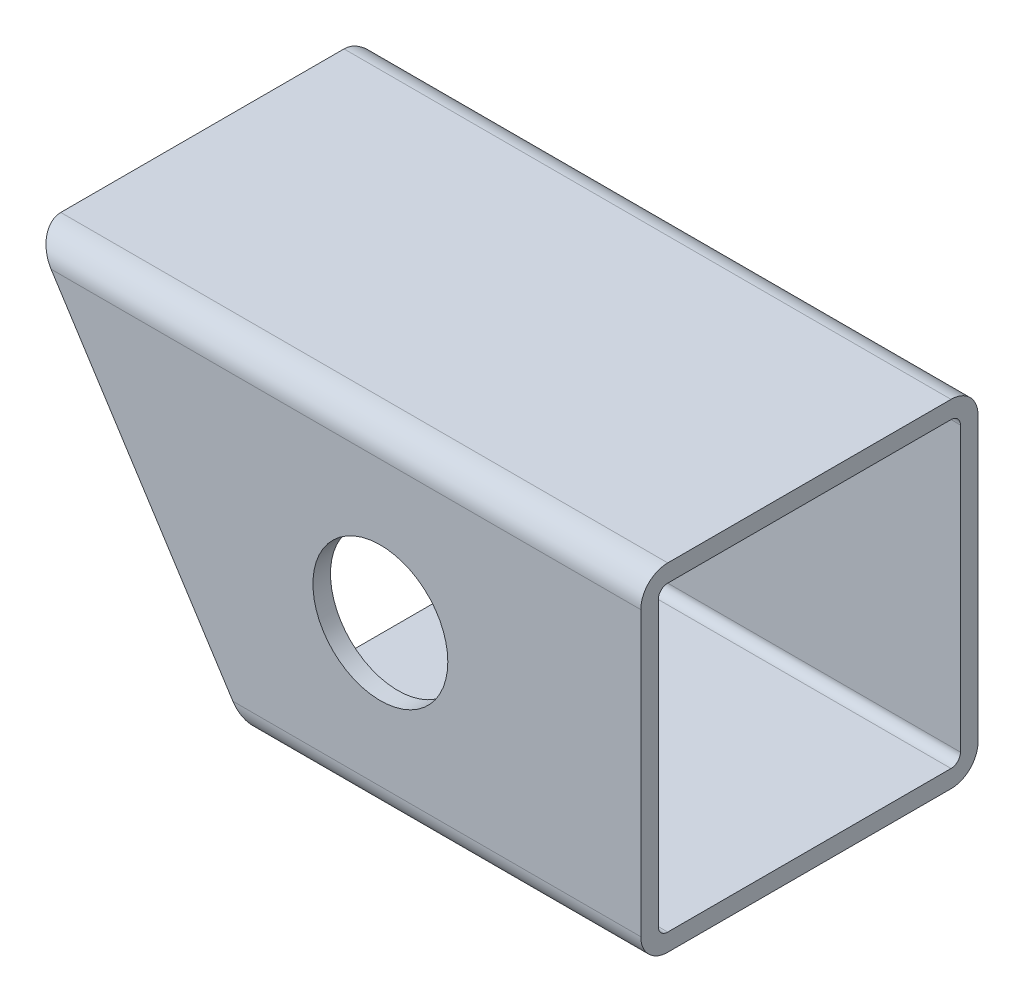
from build123d import *

# Parameters (mm, degrees)
BOSS_EXTRUDE1_DEPTH = 57.15
SKETCH2_R           = 6.35
CUT_EXTRUDE1_DEPTH  = 38.1
CUT_EXTRUDE3_DEPTH  = 38.1


with BuildPart() as part:
    # Sketch1 → Boss-Extrude1 (new body)
    with BuildSketch(Plane(origin=(0, 0, 0), x_dir=(0, 0, -1), z_dir=(1, 0, 0))):
        with BuildLine():
            Line((0, 2.54), (0, 29.21))
            ThreePointArc((0, 29.21), (-0.743948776, 31.006051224), (-2.54, 31.75))
            Line((-2.54, 31.75), (-29.21, 31.75))
            ThreePointArc((-29.21, 31.75), (-31.006051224, 31.006051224), (-31.75, 29.21))
            Line((-31.75, 29.21), (-31.75, 2.54))
            ThreePointArc((-31.75, 2.54), (-31.006051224, 0.743948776), (-29.21, 0))
            Line((-29.21, 0), (-2.54, 0))
            ThreePointArc((-2.54, 0), (-0.743948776, 0.743948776), (0, 2.54))
        make_face()
        with BuildLine():
            Line((-1.651, 2.54), (-1.651, 29.21))
            ThreePointArc((-1.651, 29.21), (-1.911382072, 29.838617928), (-2.54, 30.099))
            Line((-2.54, 30.099), (-29.21, 30.099))
            ThreePointArc((-29.21, 30.099), (-29.838617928, 29.838617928), (-30.099, 29.21))
            Line((-30.099, 29.21), (-30.099, 2.54))
            ThreePointArc((-30.099, 2.54), (-29.838617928, 1.911382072), (-29.21, 1.651))
            Line((-29.21, 1.651), (-2.54, 1.651))
            ThreePointArc((-2.54, 1.651), (-1.911382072, 1.911382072), (-1.651, 2.54))
        make_face(mode=Mode.SUBTRACT)
    extrude(amount=BOSS_EXTRUDE1_DEPTH)

    # Sketch2 → Cut-Extrude1 (cut)
    with BuildSketch(Plane.XY.offset(31.75)):
        with Locations((32.633561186, 15.875)):
            Circle(SKETCH2_R)
    extrude(amount=-CUT_EXTRUDE1_DEPTH, mode=Mode.SUBTRACT)

    # Sketch3 → Cut-Extrude3 (cut)
    with BuildSketch(Plane(origin=(0, 0, 0), x_dir=(-1, 0, 0), z_dir=(0, 0, -1))):
        Polygon((0, 31.75), (-20.376865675, 0), (-26.025549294, -8.801437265), (0, -8.801437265), align=None)
    extrude(amount=-CUT_EXTRUDE3_DEPTH, mode=Mode.SUBTRACT)


solid = part.part
